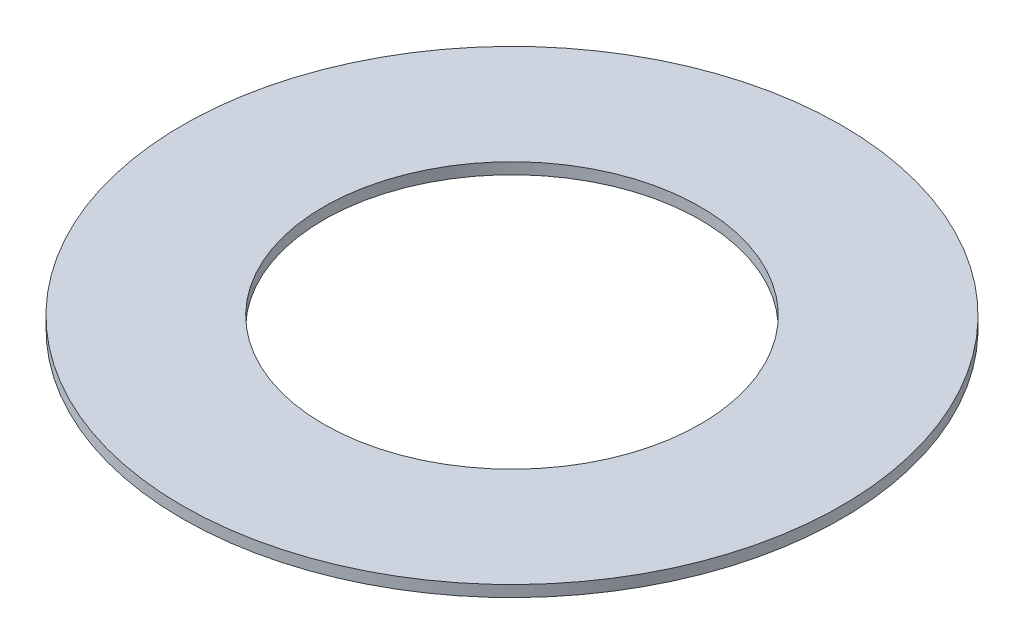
ISO-10303-21;
HEADER;
FILE_DESCRIPTION(('STEP AP214'),'2;1');
FILE_NAME('part.step','',(''),(''),'','','');
FILE_SCHEMA(('AUTOMOTIVE_DESIGN { 1 0 10303 214 1 1 1 1 }'));
ENDSEC;
DATA;
#1=APPLICATION_CONTEXT('core data for automotive mechanical design processes');
#2=APPLICATION_PROTOCOL_DEFINITION('international standard','automotive_design',2000,#1);
#3=PRODUCT_CONTEXT('',#1,'mechanical');
#4=PRODUCT('Part','Part','',(#3));
#5=PRODUCT_RELATED_PRODUCT_CATEGORY('part','',(#4));
#6=PRODUCT_DEFINITION_FORMATION('','',#4);
#7=PRODUCT_DEFINITION_CONTEXT('part definition',#1,'design');
#8=PRODUCT_DEFINITION('design','',#6,#7);
#9=PRODUCT_DEFINITION_SHAPE('','',#8);
#10=(LENGTH_UNIT() NAMED_UNIT(*) SI_UNIT(.MILLI.,.METRE.));
#11=(NAMED_UNIT(*) PLANE_ANGLE_UNIT() SI_UNIT($,.RADIAN.));
#12=(NAMED_UNIT(*) SI_UNIT($,.STERADIAN.) SOLID_ANGLE_UNIT());
#13=UNCERTAINTY_MEASURE_WITH_UNIT(LENGTH_MEASURE(1.E-05),#10,'distance_accuracy_value','');
#14=(GEOMETRIC_REPRESENTATION_CONTEXT(3) GLOBAL_UNCERTAINTY_ASSIGNED_CONTEXT((#13)) GLOBAL_UNIT_ASSIGNED_CONTEXT((#10,
#11,#12)) REPRESENTATION_CONTEXT('',''));
#15=CARTESIAN_POINT('',(0.,0.,0.));
#16=DIRECTION('',(0.,0.,1.));
#17=DIRECTION('',(1.,0.,0.));
#18=AXIS2_PLACEMENT_3D('',#15,#16,#17);
#19=CARTESIAN_POINT('',(0.,12.,0.));
#20=DIRECTION('',(0.,1.,0.));
#21=DIRECTION('',(0.,0.,1.));
#22=AXIS2_PLACEMENT_3D('',#19,#20,#21);
#23=PLANE('',#22);
#24=CARTESIAN_POINT('',(0.,12.,0.));
#25=DIRECTION('',(0.,1.,0.));
#26=DIRECTION('',(0.,0.,1.));
#27=AXIS2_PLACEMENT_3D('',#24,#25,#26);
#28=CIRCLE('',#27,350.);
#29=CARTESIAN_POINT('',(0.,12.,350.));
#30=VERTEX_POINT('',#29);
#31=EDGE_CURVE('E10',#30,#30,#28,.T.);
#32=ORIENTED_EDGE('',*,*,#31,.T.);
#33=EDGE_LOOP('',(#32));
#34=FACE_BOUND('',#33,.T.);
#35=CARTESIAN_POINT('',(0.,12.,0.));
#36=DIRECTION('',(0.,1.,0.));
#37=DIRECTION('',(0.,0.,1.));
#38=AXIS2_PLACEMENT_3D('',#35,#36,#37);
#39=CIRCLE('',#38,200.);
#40=CARTESIAN_POINT('',(0.,12.,200.));
#41=VERTEX_POINT('',#40);
#42=EDGE_CURVE('E41',#41,#41,#39,.T.);
#43=ORIENTED_EDGE('',*,*,#42,.F.);
#44=EDGE_LOOP('',(#43));
#45=FACE_BOUND('',#44,.T.);
#46=ADVANCED_FACE('F30',(#34,#45),#23,.T.);
#47=CARTESIAN_POINT('',(0.,0.,0.));
#48=DIRECTION('',(0.,1.,0.));
#49=DIRECTION('',(0.,0.,1.));
#50=AXIS2_PLACEMENT_3D('',#47,#48,#49);
#51=PLANE('',#50);
#52=CARTESIAN_POINT('',(0.,0.,0.));
#53=DIRECTION('',(0.,1.,0.));
#54=DIRECTION('',(0.,0.,1.));
#55=AXIS2_PLACEMENT_3D('',#52,#53,#54);
#56=CIRCLE('',#55,350.);
#57=CARTESIAN_POINT('',(0.,0.,350.));
#58=VERTEX_POINT('',#57);
#59=EDGE_CURVE('E34',#58,#58,#56,.T.);
#60=ORIENTED_EDGE('',*,*,#59,.F.);
#61=EDGE_LOOP('',(#60));
#62=FACE_BOUND('',#61,.T.);
#63=CARTESIAN_POINT('',(0.,0.,0.));
#64=DIRECTION('',(0.,1.,0.));
#65=DIRECTION('',(0.,0.,1.));
#66=AXIS2_PLACEMENT_3D('',#63,#64,#65);
#67=CIRCLE('',#66,200.);
#68=CARTESIAN_POINT('',(0.,0.,200.));
#69=VERTEX_POINT('',#68);
#70=EDGE_CURVE('E43',#69,#69,#67,.T.);
#71=ORIENTED_EDGE('',*,*,#70,.T.);
#72=EDGE_LOOP('',(#71));
#73=FACE_BOUND('',#72,.T.);
#74=ADVANCED_FACE('F53',(#62,#73),#51,.F.);
#75=CARTESIAN_POINT('',(0.,12.,0.));
#76=DIRECTION('',(0.,-1.,0.));
#77=DIRECTION('',(0.,0.,-1.));
#78=AXIS2_PLACEMENT_3D('',#75,#76,#77);
#79=CYLINDRICAL_SURFACE('',#78,350.);
#80=ORIENTED_EDGE('',*,*,#31,.F.);
#81=EDGE_LOOP('',(#80));
#82=FACE_BOUND('',#81,.T.);
#83=ORIENTED_EDGE('',*,*,#59,.T.);
#84=EDGE_LOOP('',(#83));
#85=FACE_BOUND('',#84,.T.);
#86=ADVANCED_FACE('F32',(#82,#85),#79,.T.);
#87=CARTESIAN_POINT('',(0.,12.,0.));
#88=DIRECTION('',(0.,-1.,0.));
#89=DIRECTION('',(0.,0.,-1.));
#90=AXIS2_PLACEMENT_3D('',#87,#88,#89);
#91=CYLINDRICAL_SURFACE('',#90,200.);
#92=ORIENTED_EDGE('',*,*,#42,.T.);
#93=EDGE_LOOP('',(#92));
#94=FACE_BOUND('',#93,.T.);
#95=ORIENTED_EDGE('',*,*,#70,.F.);
#96=EDGE_LOOP('',(#95));
#97=FACE_BOUND('',#96,.T.);
#98=ADVANCED_FACE('F49',(#94,#97),#91,.F.);
#99=CLOSED_SHELL('',(#46,#74,#86,#98));
#100=MANIFOLD_SOLID_BREP('B2',#99);
#101=ADVANCED_BREP_SHAPE_REPRESENTATION('',(#18,#100),#14);
#102=SHAPE_DEFINITION_REPRESENTATION(#9,#101);
ENDSEC;
END-ISO-10303-21;
